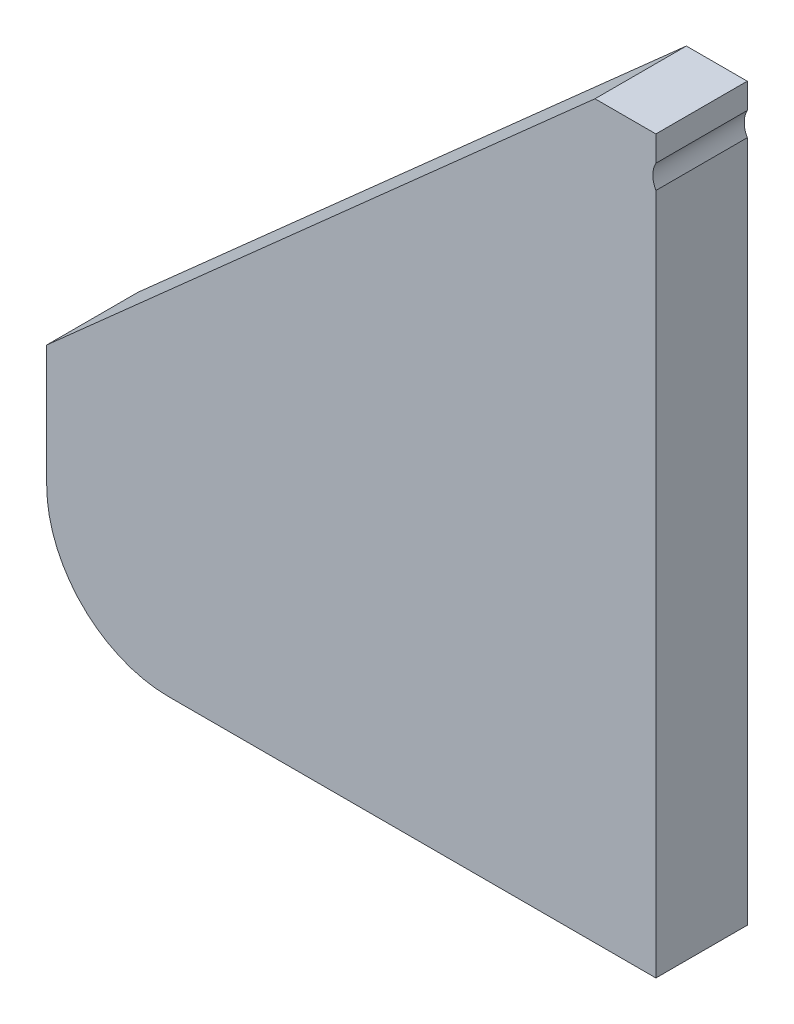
ISO-10303-21;
HEADER;
FILE_DESCRIPTION(('STEP AP214'),'2;1');
FILE_NAME('part.step','',(''),(''),'','','');
FILE_SCHEMA(('AUTOMOTIVE_DESIGN { 1 0 10303 214 1 1 1 1 }'));
ENDSEC;
DATA;
#1=APPLICATION_CONTEXT('core data for automotive mechanical design processes');
#2=APPLICATION_PROTOCOL_DEFINITION('international standard','automotive_design',2000,#1);
#3=PRODUCT_CONTEXT('',#1,'mechanical');
#4=PRODUCT('Part','Part','',(#3));
#5=PRODUCT_RELATED_PRODUCT_CATEGORY('part','',(#4));
#6=PRODUCT_DEFINITION_FORMATION('','',#4);
#7=PRODUCT_DEFINITION_CONTEXT('part definition',#1,'design');
#8=PRODUCT_DEFINITION('design','',#6,#7);
#9=PRODUCT_DEFINITION_SHAPE('','',#8);
#10=(LENGTH_UNIT() NAMED_UNIT(*) SI_UNIT(.MILLI.,.METRE.));
#11=(NAMED_UNIT(*) PLANE_ANGLE_UNIT() SI_UNIT($,.RADIAN.));
#12=(NAMED_UNIT(*) SI_UNIT($,.STERADIAN.) SOLID_ANGLE_UNIT());
#13=UNCERTAINTY_MEASURE_WITH_UNIT(LENGTH_MEASURE(1.E-05),#10,'distance_accuracy_value','');
#14=(GEOMETRIC_REPRESENTATION_CONTEXT(3) GLOBAL_UNCERTAINTY_ASSIGNED_CONTEXT((#13)) GLOBAL_UNIT_ASSIGNED_CONTEXT((#10,
#11,#12)) REPRESENTATION_CONTEXT('',''));
#15=CARTESIAN_POINT('',(0.,0.,0.));
#16=DIRECTION('',(0.,0.,1.));
#17=DIRECTION('',(1.,0.,0.));
#18=AXIS2_PLACEMENT_3D('',#15,#16,#17);
#19=CARTESIAN_POINT('',(0.,120.,15.));
#20=DIRECTION('',(-1.,0.,0.));
#21=DIRECTION('',(0.,-1.,0.));
#22=AXIS2_PLACEMENT_3D('',#19,#20,#21);
#23=PLANE('',#22);
#24=DIRECTION('',(0.,1.,0.));
#25=VECTOR('',#24,1.);
#26=CARTESIAN_POINT('',(0.,120.,15.));
#27=LINE('',#26,#25);
#28=CARTESIAN_POINT('',(0.,115.836491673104,15.));
#29=VERTEX_POINT('',#28);
#30=CARTESIAN_POINT('',(0.,120.,15.));
#31=VERTEX_POINT('',#30);
#32=EDGE_CURVE('E105',#29,#31,#27,.T.);
#33=ORIENTED_EDGE('',*,*,#32,.F.);
#34=DIRECTION('',(0.,0.,-1.));
#35=VECTOR('',#34,1.);
#36=CARTESIAN_POINT('',(0.,115.836491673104,15.));
#37=LINE('',#36,#35);
#38=CARTESIAN_POINT('',(0.,115.836491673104,0.));
#39=VERTEX_POINT('',#38);
#40=EDGE_CURVE('E94',#29,#39,#37,.T.);
#41=ORIENTED_EDGE('',*,*,#40,.T.);
#42=DIRECTION('',(0.,1.,0.));
#43=VECTOR('',#42,1.);
#44=CARTESIAN_POINT('',(0.,120.,0.));
#45=LINE('',#44,#43);
#46=CARTESIAN_POINT('',(0.,120.,0.));
#47=VERTEX_POINT('',#46);
#48=EDGE_CURVE('E149',#39,#47,#45,.T.);
#49=ORIENTED_EDGE('',*,*,#48,.T.);
#50=DIRECTION('',(0.,0.,-1.));
#51=VECTOR('',#50,1.);
#52=CARTESIAN_POINT('',(0.,120.,15.));
#53=LINE('',#52,#51);
#54=EDGE_CURVE('E111',#31,#47,#53,.T.);
#55=ORIENTED_EDGE('',*,*,#54,.F.);
#56=EDGE_LOOP('',(#33,#41,#49,#55));
#57=FACE_BOUND('',#56,.T.);
#58=ADVANCED_FACE('F31',(#57),#23,.F.);
#59=CARTESIAN_POINT('',(-80.,20.,15.));
#60=DIRECTION('',(0.,0.,-1.));
#61=DIRECTION('',(-1.,0.,0.));
#62=AXIS2_PLACEMENT_3D('',#59,#60,#61);
#63=CYLINDRICAL_SURFACE('',#62,20.);
#64=CARTESIAN_POINT('',(-80.,20.,0.));
#65=DIRECTION('',(0.,0.,1.));
#66=DIRECTION('',(-1.,0.,0.));
#67=AXIS2_PLACEMENT_3D('',#64,#65,#66);
#68=CIRCLE('',#67,20.);
#69=CARTESIAN_POINT('',(-100.,20.0000000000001,0.));
#70=VERTEX_POINT('',#69);
#71=CARTESIAN_POINT('',(-79.9999999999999,0.,0.));
#72=VERTEX_POINT('',#71);
#73=EDGE_CURVE('E101',#70,#72,#68,.T.);
#74=ORIENTED_EDGE('',*,*,#73,.T.);
#75=DIRECTION('',(0.,0.,-1.));
#76=VECTOR('',#75,1.);
#77=CARTESIAN_POINT('',(-79.9999999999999,0.,15.));
#78=LINE('',#77,#76);
#79=CARTESIAN_POINT('',(-79.9999999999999,0.,15.));
#80=VERTEX_POINT('',#79);
#81=EDGE_CURVE('E39',#80,#72,#78,.T.);
#82=ORIENTED_EDGE('',*,*,#81,.F.);
#83=CARTESIAN_POINT('',(-80.,20.,15.));
#84=DIRECTION('',(0.,0.,1.));
#85=DIRECTION('',(-1.,0.,0.));
#86=AXIS2_PLACEMENT_3D('',#83,#84,#85);
#87=CIRCLE('',#86,20.);
#88=CARTESIAN_POINT('',(-100.,20.0000000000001,15.));
#89=VERTEX_POINT('',#88);
#90=EDGE_CURVE('E116',#89,#80,#87,.T.);
#91=ORIENTED_EDGE('',*,*,#90,.F.);
#92=DIRECTION('',(0.,0.,-1.));
#93=VECTOR('',#92,1.);
#94=CARTESIAN_POINT('',(-100.,20.0000000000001,15.));
#95=LINE('',#94,#93);
#96=EDGE_CURVE('E124',#89,#70,#95,.T.);
#97=ORIENTED_EDGE('',*,*,#96,.T.);
#98=EDGE_LOOP('',(#74,#82,#91,#97));
#99=FACE_BOUND('',#98,.T.);
#100=ADVANCED_FACE('F33',(#99),#63,.T.);
#101=CARTESIAN_POINT('',(-79.9999999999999,0.,15.));
#102=DIRECTION('',(0.,1.,0.));
#103=DIRECTION('',(0.,0.,1.));
#104=AXIS2_PLACEMENT_3D('',#101,#102,#103);
#105=PLANE('',#104);
#106=DIRECTION('',(1.,0.,0.));
#107=VECTOR('',#106,1.);
#108=CARTESIAN_POINT('',(-79.9999999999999,0.,0.));
#109=LINE('',#108,#107);
#110=CARTESIAN_POINT('',(0.,0.,0.));
#111=VERTEX_POINT('',#110);
#112=EDGE_CURVE('E142',#72,#111,#109,.T.);
#113=ORIENTED_EDGE('',*,*,#112,.T.);
#114=DIRECTION('',(0.,0.,-1.));
#115=VECTOR('',#114,1.);
#116=CARTESIAN_POINT('',(0.,0.,15.));
#117=LINE('',#116,#115);
#118=CARTESIAN_POINT('',(0.,0.,15.));
#119=VERTEX_POINT('',#118);
#120=EDGE_CURVE('E134',#119,#111,#117,.T.);
#121=ORIENTED_EDGE('',*,*,#120,.F.);
#122=DIRECTION('',(1.,0.,0.));
#123=VECTOR('',#122,1.);
#124=CARTESIAN_POINT('',(-79.9999999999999,0.,15.));
#125=LINE('',#124,#123);
#126=EDGE_CURVE('E113',#80,#119,#125,.T.);
#127=ORIENTED_EDGE('',*,*,#126,.F.);
#128=ORIENTED_EDGE('',*,*,#81,.T.);
#129=EDGE_LOOP('',(#113,#121,#127,#128));
#130=FACE_BOUND('',#129,.T.);
#131=ADVANCED_FACE('F140',(#130),#105,.F.);
#132=CARTESIAN_POINT('',(0.,111.963508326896,0.));
#133=VERTEX_POINT('',#132);
#134=EDGE_CURVE('E153',#111,#133,#45,.T.);
#135=ORIENTED_EDGE('',*,*,#134,.T.);
#136=DIRECTION('',(0.,0.,-1.));
#137=VECTOR('',#136,1.);
#138=CARTESIAN_POINT('',(0.,111.963508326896,15.));
#139=LINE('',#138,#137);
#140=CARTESIAN_POINT('',(0.,111.963508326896,15.));
#141=VERTEX_POINT('',#140);
#142=EDGE_CURVE('E45',#133,#141,#139,.F.);
#143=ORIENTED_EDGE('',*,*,#142,.T.);
#144=EDGE_CURVE('E108',#119,#141,#27,.T.);
#145=ORIENTED_EDGE('',*,*,#144,.F.);
#146=ORIENTED_EDGE('',*,*,#120,.T.);
#147=EDGE_LOOP('',(#135,#143,#145,#146));
#148=FACE_BOUND('',#147,.T.);
#149=ADVANCED_FACE('F163',(#148),#23,.F.);
#150=CARTESIAN_POINT('',(-10.,120.,15.));
#151=DIRECTION('',(0.,-1.,0.));
#152=DIRECTION('',(0.,0.,-1.));
#153=AXIS2_PLACEMENT_3D('',#150,#151,#152);
#154=PLANE('',#153);
#155=DIRECTION('',(-1.,0.,0.));
#156=VECTOR('',#155,1.);
#157=CARTESIAN_POINT('',(-10.,120.,0.));
#158=LINE('',#157,#156);
#159=CARTESIAN_POINT('',(-10.,120.,0.));
#160=VERTEX_POINT('',#159);
#161=EDGE_CURVE('E156',#47,#160,#158,.T.);
#162=ORIENTED_EDGE('',*,*,#161,.T.);
#163=DIRECTION('',(0.,0.,-1.));
#164=VECTOR('',#163,1.);
#165=CARTESIAN_POINT('',(-10.,120.,15.));
#166=LINE('',#165,#164);
#167=CARTESIAN_POINT('',(-10.,120.,15.));
#168=VERTEX_POINT('',#167);
#169=EDGE_CURVE('E130',#168,#160,#166,.T.);
#170=ORIENTED_EDGE('',*,*,#169,.F.);
#171=DIRECTION('',(-1.,0.,0.));
#172=VECTOR('',#171,1.);
#173=CARTESIAN_POINT('',(-10.,120.,15.));
#174=LINE('',#173,#172);
#175=EDGE_CURVE('E115',#31,#168,#174,.T.);
#176=ORIENTED_EDGE('',*,*,#175,.F.);
#177=ORIENTED_EDGE('',*,*,#54,.T.);
#178=EDGE_LOOP('',(#162,#170,#176,#177));
#179=FACE_BOUND('',#178,.T.);
#180=ADVANCED_FACE('F168',(#179),#154,.F.);
#181=CARTESIAN_POINT('',(-10.,120.,15.));
#182=DIRECTION('',(0.66436383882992,-0.74740931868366,0.));
#183=DIRECTION('',(0.74740931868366,0.66436383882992,0.));
#184=AXIS2_PLACEMENT_3D('',#181,#182,#183);
#185=PLANE('',#184);
#186=DIRECTION('',(-0.74740931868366,-0.66436383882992,0.));
#187=VECTOR('',#186,1.);
#188=CARTESIAN_POINT('',(-10.,120.,0.));
#189=LINE('',#188,#187);
#190=CARTESIAN_POINT('',(-100.,40.,0.));
#191=VERTEX_POINT('',#190);
#192=EDGE_CURVE('E158',#160,#191,#189,.T.);
#193=ORIENTED_EDGE('',*,*,#192,.T.);
#194=DIRECTION('',(0.,0.,-1.));
#195=VECTOR('',#194,1.);
#196=CARTESIAN_POINT('',(-100.,40.,15.));
#197=LINE('',#196,#195);
#198=CARTESIAN_POINT('',(-100.,40.,15.));
#199=VERTEX_POINT('',#198);
#200=EDGE_CURVE('E127',#199,#191,#197,.T.);
#201=ORIENTED_EDGE('',*,*,#200,.F.);
#202=DIRECTION('',(-0.74740931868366,-0.66436383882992,0.));
#203=VECTOR('',#202,1.);
#204=CARTESIAN_POINT('',(-10.,120.,15.));
#205=LINE('',#204,#203);
#206=EDGE_CURVE('E121',#168,#199,#205,.T.);
#207=ORIENTED_EDGE('',*,*,#206,.F.);
#208=ORIENTED_EDGE('',*,*,#169,.T.);
#209=EDGE_LOOP('',(#193,#201,#207,#208));
#210=FACE_BOUND('',#209,.T.);
#211=ADVANCED_FACE('F173',(#210),#185,.F.);
#212=CARTESIAN_POINT('',(-100.,40.,15.));
#213=DIRECTION('',(1.,0.,0.));
#214=DIRECTION('',(0.,0.,-1.));
#215=AXIS2_PLACEMENT_3D('',#212,#213,#214);
#216=PLANE('',#215);
#217=DIRECTION('',(0.,-1.,0.));
#218=VECTOR('',#217,1.);
#219=CARTESIAN_POINT('',(-100.,40.,0.));
#220=LINE('',#219,#218);
#221=EDGE_CURVE('E160',#191,#70,#220,.T.);
#222=ORIENTED_EDGE('',*,*,#221,.T.);
#223=ORIENTED_EDGE('',*,*,#96,.F.);
#224=DIRECTION('',(0.,-1.,0.));
#225=VECTOR('',#224,1.);
#226=CARTESIAN_POINT('',(-100.,40.,15.));
#227=LINE('',#226,#225);
#228=EDGE_CURVE('E53',#199,#89,#227,.T.);
#229=ORIENTED_EDGE('',*,*,#228,.F.);
#230=ORIENTED_EDGE('',*,*,#200,.T.);
#231=EDGE_LOOP('',(#222,#223,#229,#230));
#232=FACE_BOUND('',#231,.T.);
#233=ADVANCED_FACE('F175',(#232),#216,.F.);
#234=CARTESIAN_POINT('',(-80.,20.,15.));
#235=DIRECTION('',(0.,0.,-1.));
#236=DIRECTION('',(-1.,0.,0.));
#237=AXIS2_PLACEMENT_3D('',#234,#235,#236);
#238=PLANE('',#237);
#239=ORIENTED_EDGE('',*,*,#144,.T.);
#240=CARTESIAN_POINT('',(3.5,113.9,15.));
#241=DIRECTION('',(0.,0.,-1.));
#242=DIRECTION('',(-1.,0.,0.));
#243=AXIS2_PLACEMENT_3D('',#240,#241,#242);
#244=CIRCLE('',#243,4.00000000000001);
#245=EDGE_CURVE('E97',#141,#29,#244,.T.);
#246=ORIENTED_EDGE('',*,*,#245,.T.);
#247=ORIENTED_EDGE('',*,*,#32,.T.);
#248=ORIENTED_EDGE('',*,*,#175,.T.);
#249=ORIENTED_EDGE('',*,*,#206,.T.);
#250=ORIENTED_EDGE('',*,*,#228,.T.);
#251=ORIENTED_EDGE('',*,*,#90,.T.);
#252=ORIENTED_EDGE('',*,*,#126,.T.);
#253=EDGE_LOOP('',(#239,#246,#247,#248,#249,#250,#251,#252));
#254=FACE_BOUND('',#253,.T.);
#255=ADVANCED_FACE('F104',(#254),#238,.F.);
#256=CARTESIAN_POINT('',(-80.,20.,0.));
#257=DIRECTION('',(0.,0.,-1.));
#258=DIRECTION('',(-1.,0.,0.));
#259=AXIS2_PLACEMENT_3D('',#256,#257,#258);
#260=PLANE('',#259);
#261=CARTESIAN_POINT('',(3.5,113.9,0.));
#262=DIRECTION('',(0.,0.,-1.));
#263=DIRECTION('',(-1.,0.,0.));
#264=AXIS2_PLACEMENT_3D('',#261,#262,#263);
#265=CIRCLE('',#264,4.00000000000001);
#266=EDGE_CURVE('E11',#133,#39,#265,.T.);
#267=ORIENTED_EDGE('',*,*,#266,.F.);
#268=ORIENTED_EDGE('',*,*,#134,.F.);
#269=ORIENTED_EDGE('',*,*,#112,.F.);
#270=ORIENTED_EDGE('',*,*,#73,.F.);
#271=ORIENTED_EDGE('',*,*,#221,.F.);
#272=ORIENTED_EDGE('',*,*,#192,.F.);
#273=ORIENTED_EDGE('',*,*,#161,.F.);
#274=ORIENTED_EDGE('',*,*,#48,.F.);
#275=EDGE_LOOP('',(#267,#268,#269,#270,#271,#272,#273,#274));
#276=FACE_BOUND('',#275,.T.);
#277=ADVANCED_FACE('F164',(#276),#260,.T.);
#278=CARTESIAN_POINT('',(3.5,113.9,15.));
#279=DIRECTION('',(0.,0.,-1.));
#280=DIRECTION('',(-1.,0.,0.));
#281=AXIS2_PLACEMENT_3D('',#278,#279,#280);
#282=CYLINDRICAL_SURFACE('',#281,4.00000000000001);
#283=ORIENTED_EDGE('',*,*,#245,.F.);
#284=ORIENTED_EDGE('',*,*,#142,.F.);
#285=ORIENTED_EDGE('',*,*,#266,.T.);
#286=ORIENTED_EDGE('',*,*,#40,.F.);
#287=EDGE_LOOP('',(#283,#284,#285,#286));
#288=FACE_BOUND('',#287,.T.);
#289=ADVANCED_FACE('F96',(#288),#282,.F.);
#290=CLOSED_SHELL('',(#58,#100,#131,#149,#180,#211,#233,#255,#277,#289));
#291=MANIFOLD_SOLID_BREP('B2',#290);
#292=ADVANCED_BREP_SHAPE_REPRESENTATION('',(#18,#291),#14);
#293=SHAPE_DEFINITION_REPRESENTATION(#9,#292);
ENDSEC;
END-ISO-10303-21;
